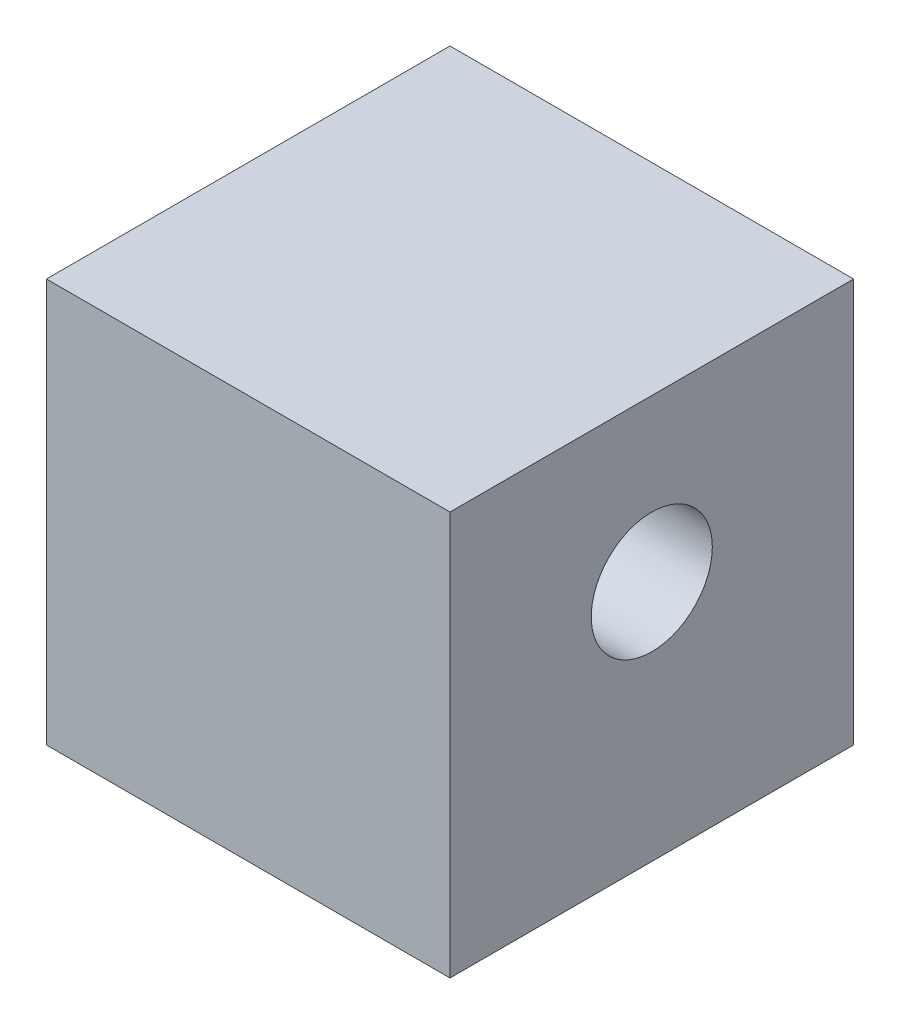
ISO-10303-21;
HEADER;
FILE_DESCRIPTION(('STEP AP214'),'2;1');
FILE_NAME('part.step','',(''),(''),'','','');
FILE_SCHEMA(('AUTOMOTIVE_DESIGN { 1 0 10303 214 1 1 1 1 }'));
ENDSEC;
DATA;
#1=APPLICATION_CONTEXT('core data for automotive mechanical design processes');
#2=APPLICATION_PROTOCOL_DEFINITION('international standard','automotive_design',2000,#1);
#3=PRODUCT_CONTEXT('',#1,'mechanical');
#4=PRODUCT('Part','Part','',(#3));
#5=PRODUCT_RELATED_PRODUCT_CATEGORY('part','',(#4));
#6=PRODUCT_DEFINITION_FORMATION('','',#4);
#7=PRODUCT_DEFINITION_CONTEXT('part definition',#1,'design');
#8=PRODUCT_DEFINITION('design','',#6,#7);
#9=PRODUCT_DEFINITION_SHAPE('','',#8);
#10=(LENGTH_UNIT() NAMED_UNIT(*) SI_UNIT(.MILLI.,.METRE.));
#11=(NAMED_UNIT(*) PLANE_ANGLE_UNIT() SI_UNIT($,.RADIAN.));
#12=(NAMED_UNIT(*) SI_UNIT($,.STERADIAN.) SOLID_ANGLE_UNIT());
#13=UNCERTAINTY_MEASURE_WITH_UNIT(LENGTH_MEASURE(1.E-05),#10,'distance_accuracy_value','');
#14=(GEOMETRIC_REPRESENTATION_CONTEXT(3) GLOBAL_UNCERTAINTY_ASSIGNED_CONTEXT((#13)) GLOBAL_UNIT_ASSIGNED_CONTEXT((#10,
#11,#12)) REPRESENTATION_CONTEXT('',''));
#15=CARTESIAN_POINT('',(0.,0.,0.));
#16=DIRECTION('',(0.,0.,1.));
#17=DIRECTION('',(1.,0.,0.));
#18=AXIS2_PLACEMENT_3D('',#15,#16,#17);
#19=CARTESIAN_POINT('',(-50.,100.,50.));
#20=DIRECTION('',(1.,0.,0.));
#21=DIRECTION('',(0.,0.,-1.));
#22=AXIS2_PLACEMENT_3D('',#19,#20,#21);
#23=PLANE('',#22);
#24=CARTESIAN_POINT('',(-50.,60.,0.));
#25=DIRECTION('',(1.,0.,0.));
#26=DIRECTION('',(0.,0.,-1.));
#27=AXIS2_PLACEMENT_3D('',#24,#25,#26);
#28=CIRCLE('',#27,15.);
#29=CARTESIAN_POINT('',(-50.,60.,-15.));
#30=VERTEX_POINT('',#29);
#31=EDGE_CURVE('E113',#30,#30,#28,.T.);
#32=ORIENTED_EDGE('',*,*,#31,.T.);
#33=EDGE_LOOP('',(#32));
#34=FACE_BOUND('',#33,.T.);
#35=DIRECTION('',(0.,0.,1.));
#36=VECTOR('',#35,1.);
#37=CARTESIAN_POINT('',(-50.,0.,50.));
#38=LINE('',#37,#36);
#39=CARTESIAN_POINT('',(-50.,0.,-50.));
#40=VERTEX_POINT('',#39);
#41=CARTESIAN_POINT('',(-50.,0.,50.));
#42=VERTEX_POINT('',#41);
#43=EDGE_CURVE('E110',#40,#42,#38,.T.);
#44=ORIENTED_EDGE('',*,*,#43,.T.);
#45=DIRECTION('',(0.,-1.,0.));
#46=VECTOR('',#45,1.);
#47=CARTESIAN_POINT('',(-50.,100.,50.));
#48=LINE('',#47,#46);
#49=CARTESIAN_POINT('',(-50.,100.,50.));
#50=VERTEX_POINT('',#49);
#51=EDGE_CURVE('E13',#50,#42,#48,.T.);
#52=ORIENTED_EDGE('',*,*,#51,.F.);
#53=DIRECTION('',(0.,0.,1.));
#54=VECTOR('',#53,1.);
#55=CARTESIAN_POINT('',(-50.,100.,50.));
#56=LINE('',#55,#54);
#57=CARTESIAN_POINT('',(-50.,100.,-50.));
#58=VERTEX_POINT('',#57);
#59=EDGE_CURVE('E98',#58,#50,#56,.T.);
#60=ORIENTED_EDGE('',*,*,#59,.F.);
#61=DIRECTION('',(0.,-1.,0.));
#62=VECTOR('',#61,1.);
#63=CARTESIAN_POINT('',(-50.,100.,-50.));
#64=LINE('',#63,#62);
#65=EDGE_CURVE('E106',#58,#40,#64,.T.);
#66=ORIENTED_EDGE('',*,*,#65,.T.);
#67=EDGE_LOOP('',(#44,#52,#60,#66));
#68=FACE_BOUND('',#67,.T.);
#69=ADVANCED_FACE('F47',(#34,#68),#23,.F.);
#70=CARTESIAN_POINT('',(50.,100.,50.));
#71=DIRECTION('',(0.,0.,-1.));
#72=DIRECTION('',(-1.,0.,0.));
#73=AXIS2_PLACEMENT_3D('',#70,#71,#72);
#74=PLANE('',#73);
#75=DIRECTION('',(1.,0.,0.));
#76=VECTOR('',#75,1.);
#77=CARTESIAN_POINT('',(50.,0.,50.));
#78=LINE('',#77,#76);
#79=CARTESIAN_POINT('',(50.,0.,50.));
#80=VERTEX_POINT('',#79);
#81=EDGE_CURVE('E102',#42,#80,#78,.T.);
#82=ORIENTED_EDGE('',*,*,#81,.T.);
#83=DIRECTION('',(0.,-1.,0.));
#84=VECTOR('',#83,1.);
#85=CARTESIAN_POINT('',(50.,100.,50.));
#86=LINE('',#85,#84);
#87=CARTESIAN_POINT('',(50.,100.,50.));
#88=VERTEX_POINT('',#87);
#89=EDGE_CURVE('E55',#88,#80,#86,.T.);
#90=ORIENTED_EDGE('',*,*,#89,.F.);
#91=DIRECTION('',(1.,0.,0.));
#92=VECTOR('',#91,1.);
#93=CARTESIAN_POINT('',(50.,100.,50.));
#94=LINE('',#93,#92);
#95=EDGE_CURVE('E93',#50,#88,#94,.T.);
#96=ORIENTED_EDGE('',*,*,#95,.F.);
#97=ORIENTED_EDGE('',*,*,#51,.T.);
#98=EDGE_LOOP('',(#82,#90,#96,#97));
#99=FACE_BOUND('',#98,.T.);
#100=ADVANCED_FACE('F101',(#99),#74,.F.);
#101=CARTESIAN_POINT('',(50.,100.,50.));
#102=DIRECTION('',(-1.,0.,0.));
#103=DIRECTION('',(0.,0.,1.));
#104=AXIS2_PLACEMENT_3D('',#101,#102,#103);
#105=PLANE('',#104);
#106=CARTESIAN_POINT('',(50.,60.,0.));
#107=DIRECTION('',(1.,0.,0.));
#108=DIRECTION('',(0.,0.,-1.));
#109=AXIS2_PLACEMENT_3D('',#106,#107,#108);
#110=CIRCLE('',#109,15.);
#111=CARTESIAN_POINT('',(50.,60.,-15.));
#112=VERTEX_POINT('',#111);
#113=EDGE_CURVE('E124',#112,#112,#110,.T.);
#114=ORIENTED_EDGE('',*,*,#113,.F.);
#115=EDGE_LOOP('',(#114));
#116=FACE_BOUND('',#115,.T.);
#117=DIRECTION('',(0.,0.,-1.));
#118=VECTOR('',#117,1.);
#119=CARTESIAN_POINT('',(50.,0.,50.));
#120=LINE('',#119,#118);
#121=CARTESIAN_POINT('',(50.,0.,-50.));
#122=VERTEX_POINT('',#121);
#123=EDGE_CURVE('E80',#80,#122,#120,.T.);
#124=ORIENTED_EDGE('',*,*,#123,.T.);
#125=DIRECTION('',(0.,-1.,0.));
#126=VECTOR('',#125,1.);
#127=CARTESIAN_POINT('',(50.,100.,-50.));
#128=LINE('',#127,#126);
#129=CARTESIAN_POINT('',(50.,100.,-50.));
#130=VERTEX_POINT('',#129);
#131=EDGE_CURVE('E103',#130,#122,#128,.T.);
#132=ORIENTED_EDGE('',*,*,#131,.F.);
#133=DIRECTION('',(0.,0.,-1.));
#134=VECTOR('',#133,1.);
#135=CARTESIAN_POINT('',(50.,100.,50.));
#136=LINE('',#135,#134);
#137=EDGE_CURVE('E96',#88,#130,#136,.T.);
#138=ORIENTED_EDGE('',*,*,#137,.F.);
#139=ORIENTED_EDGE('',*,*,#89,.T.);
#140=EDGE_LOOP('',(#124,#132,#138,#139));
#141=FACE_BOUND('',#140,.T.);
#142=ADVANCED_FACE('F104',(#116,#141),#105,.F.);
#143=CARTESIAN_POINT('',(50.,100.,-50.));
#144=DIRECTION('',(0.,0.,1.));
#145=DIRECTION('',(1.,0.,0.));
#146=AXIS2_PLACEMENT_3D('',#143,#144,#145);
#147=PLANE('',#146);
#148=DIRECTION('',(-1.,0.,0.));
#149=VECTOR('',#148,1.);
#150=CARTESIAN_POINT('',(50.,0.,-50.));
#151=LINE('',#150,#149);
#152=EDGE_CURVE('E86',#122,#40,#151,.T.);
#153=ORIENTED_EDGE('',*,*,#152,.T.);
#154=ORIENTED_EDGE('',*,*,#65,.F.);
#155=DIRECTION('',(-1.,0.,0.));
#156=VECTOR('',#155,1.);
#157=CARTESIAN_POINT('',(50.,100.,-50.));
#158=LINE('',#157,#156);
#159=EDGE_CURVE('E63',#130,#58,#158,.T.);
#160=ORIENTED_EDGE('',*,*,#159,.F.);
#161=ORIENTED_EDGE('',*,*,#131,.T.);
#162=EDGE_LOOP('',(#153,#154,#160,#161));
#163=FACE_BOUND('',#162,.T.);
#164=ADVANCED_FACE('F118',(#163),#147,.F.);
#165=CARTESIAN_POINT('',(0.,100.,0.));
#166=DIRECTION('',(0.,1.,0.));
#167=DIRECTION('',(0.,0.,1.));
#168=AXIS2_PLACEMENT_3D('',#165,#166,#167);
#169=PLANE('',#168);
#170=ORIENTED_EDGE('',*,*,#59,.T.);
#171=ORIENTED_EDGE('',*,*,#95,.T.);
#172=ORIENTED_EDGE('',*,*,#137,.T.);
#173=ORIENTED_EDGE('',*,*,#159,.T.);
#174=EDGE_LOOP('',(#170,#171,#172,#173));
#175=FACE_BOUND('',#174,.T.);
#176=ADVANCED_FACE('F94',(#175),#169,.T.);
#177=CARTESIAN_POINT('',(0.,0.,0.));
#178=DIRECTION('',(0.,1.,0.));
#179=DIRECTION('',(0.,0.,1.));
#180=AXIS2_PLACEMENT_3D('',#177,#178,#179);
#181=PLANE('',#180);
#182=ORIENTED_EDGE('',*,*,#43,.F.);
#183=ORIENTED_EDGE('',*,*,#152,.F.);
#184=ORIENTED_EDGE('',*,*,#123,.F.);
#185=ORIENTED_EDGE('',*,*,#81,.F.);
#186=EDGE_LOOP('',(#182,#183,#184,#185));
#187=FACE_BOUND('',#186,.T.);
#188=ADVANCED_FACE('F121',(#187),#181,.F.);
#189=CARTESIAN_POINT('',(-50.,60.,0.));
#190=DIRECTION('',(1.,0.,0.));
#191=DIRECTION('',(0.,0.,-1.));
#192=AXIS2_PLACEMENT_3D('',#189,#190,#191);
#193=CYLINDRICAL_SURFACE('',#192,15.);
#194=CARTESIAN_POINT('',(-50.,60.,-15.));
#195=CARTESIAN_POINT('',(-48.9583333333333,60.,-15.));
#196=CARTESIAN_POINT('',(-47.9166666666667,60.,-15.));
#197=CARTESIAN_POINT('',(-45.8333333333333,60.,-15.));
#198=CARTESIAN_POINT('',(-44.7916666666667,60.,-15.));
#199=CARTESIAN_POINT('',(-42.7083333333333,60.,-15.));
#200=CARTESIAN_POINT('',(-41.6666666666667,60.,-15.));
#201=CARTESIAN_POINT('',(-39.5833333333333,60.,-15.));
#202=CARTESIAN_POINT('',(-38.5416666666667,60.,-15.));
#203=CARTESIAN_POINT('',(-36.4583333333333,60.,-15.));
#204=CARTESIAN_POINT('',(-35.4166666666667,60.,-15.));
#205=CARTESIAN_POINT('',(-33.3333333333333,60.,-15.));
#206=CARTESIAN_POINT('',(-32.2916666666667,60.,-15.));
#207=CARTESIAN_POINT('',(-30.2083333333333,60.,-15.));
#208=CARTESIAN_POINT('',(-29.1666666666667,60.,-15.));
#209=CARTESIAN_POINT('',(-27.0833333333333,60.,-15.));
#210=CARTESIAN_POINT('',(-26.0416666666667,60.,-15.));
#211=CARTESIAN_POINT('',(-23.9583333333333,60.,-15.));
#212=CARTESIAN_POINT('',(-22.9166666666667,60.,-15.));
#213=CARTESIAN_POINT('',(-20.8333333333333,60.,-15.));
#214=CARTESIAN_POINT('',(-19.7916666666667,60.,-15.));
#215=CARTESIAN_POINT('',(-17.7083333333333,60.,-15.));
#216=CARTESIAN_POINT('',(-16.6666666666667,60.,-15.));
#217=CARTESIAN_POINT('',(-14.5833333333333,60.,-15.));
#218=CARTESIAN_POINT('',(-13.5416666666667,60.,-15.));
#219=CARTESIAN_POINT('',(-11.4583333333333,60.,-15.));
#220=CARTESIAN_POINT('',(-10.4166666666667,60.,-15.));
#221=CARTESIAN_POINT('',(-8.33333333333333,60.,-15.));
#222=CARTESIAN_POINT('',(-7.29166666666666,60.,-15.));
#223=CARTESIAN_POINT('',(-5.20833333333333,60.,-15.));
#224=CARTESIAN_POINT('',(-4.16666666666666,60.,-15.));
#225=CARTESIAN_POINT('',(-2.08333333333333,60.,-15.));
#226=CARTESIAN_POINT('',(-1.04166666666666,60.,-15.));
#227=CARTESIAN_POINT('',(1.04166666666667,60.,-15.));
#228=CARTESIAN_POINT('',(2.08333333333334,60.,-15.));
#229=CARTESIAN_POINT('',(4.16666666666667,60.,-15.));
#230=CARTESIAN_POINT('',(5.20833333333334,60.,-15.));
#231=CARTESIAN_POINT('',(7.29166666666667,60.,-15.));
#232=CARTESIAN_POINT('',(8.33333333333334,60.,-15.));
#233=CARTESIAN_POINT('',(10.4166666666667,60.,-15.));
#234=CARTESIAN_POINT('',(11.4583333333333,60.,-15.));
#235=CARTESIAN_POINT('',(13.5416666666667,60.,-15.));
#236=CARTESIAN_POINT('',(14.5833333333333,60.,-15.));
#237=CARTESIAN_POINT('',(16.6666666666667,60.,-15.));
#238=CARTESIAN_POINT('',(17.7083333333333,60.,-15.));
#239=CARTESIAN_POINT('',(19.7916666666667,60.,-15.));
#240=CARTESIAN_POINT('',(20.8333333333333,60.,-15.));
#241=CARTESIAN_POINT('',(22.9166666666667,60.,-15.));
#242=CARTESIAN_POINT('',(23.9583333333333,60.,-15.));
#243=CARTESIAN_POINT('',(26.0416666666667,60.,-15.));
#244=CARTESIAN_POINT('',(27.0833333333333,60.,-15.));
#245=CARTESIAN_POINT('',(29.1666666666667,60.,-15.));
#246=CARTESIAN_POINT('',(30.2083333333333,60.,-15.));
#247=CARTESIAN_POINT('',(32.2916666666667,60.,-15.));
#248=CARTESIAN_POINT('',(33.3333333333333,60.,-15.));
#249=CARTESIAN_POINT('',(35.4166666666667,60.,-15.));
#250=CARTESIAN_POINT('',(36.4583333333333,60.,-15.));
#251=CARTESIAN_POINT('',(38.5416666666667,60.,-15.));
#252=CARTESIAN_POINT('',(39.5833333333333,60.,-15.));
#253=CARTESIAN_POINT('',(41.6666666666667,60.,-15.));
#254=CARTESIAN_POINT('',(42.7083333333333,60.,-15.));
#255=CARTESIAN_POINT('',(44.7916666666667,60.,-15.));
#256=CARTESIAN_POINT('',(45.8333333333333,60.,-15.));
#257=CARTESIAN_POINT('',(47.9166666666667,60.,-15.));
#258=CARTESIAN_POINT('',(48.9583333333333,60.,-15.));
#259=CARTESIAN_POINT('',(50.,60.,-15.));
#260=B_SPLINE_CURVE_WITH_KNOTS('',3,(#194,#195,#196,#197,#198,#199,#200,#201,#202,#203,#204,
#205,#206,#207,#208,#209,#210,#211,#212,#213,#214,#215,#216,#217,#218,#219,#220,#221,#222,#223,
#224,#225,#226,#227,#228,#229,#230,#231,#232,#233,#234,#235,#236,#237,#238,#239,#240,#241,#242,
#243,#244,#245,#246,#247,#248,#249,#250,#251,#252,#253,#254,#255,#256,#257,#258,#259),
.UNSPECIFIED.,.F.,.F.,(4,2,2,2,2,2,2,2,2,2,2,2,2,2,2,2,2,2,2,2,2,2,2,2,2,2,2,2,2,2,2,2,4),(0.,
3.125,6.25,9.37499999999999,12.5,15.625,18.75,21.875,25.,28.125,31.25,34.375,37.5,40.625,43.75,
46.875,50.,53.125,56.25,59.375,62.5,65.625,68.75,71.875,75.,78.125,81.25,84.375,87.5,90.625,
93.75,96.875,100.),.UNSPECIFIED.);
#261=EDGE_CURVE('BSEAM131',#30,#112,#260,.T.);
#262=ORIENTED_EDGE('',*,*,#31,.F.);
#263=ORIENTED_EDGE('',*,*,#113,.T.);
#264=ORIENTED_EDGE('',*,*,#261,.T.);
#265=ORIENTED_EDGE('',*,*,#261,.F.);
#266=EDGE_LOOP('',(#262,#264,#263,#265));
#267=FACE_BOUND('',#266,.T.);
#268=ADVANCED_FACE('F131',(#267),#193,.F.);
#269=CLOSED_SHELL('',(#69,#100,#142,#164,#176,#188,#268));
#270=MANIFOLD_SOLID_BREP('B2',#269);
#271=ADVANCED_BREP_SHAPE_REPRESENTATION('',(#18,#270),#14);
#272=SHAPE_DEFINITION_REPRESENTATION(#9,#271);
ENDSEC;
END-ISO-10303-21;
